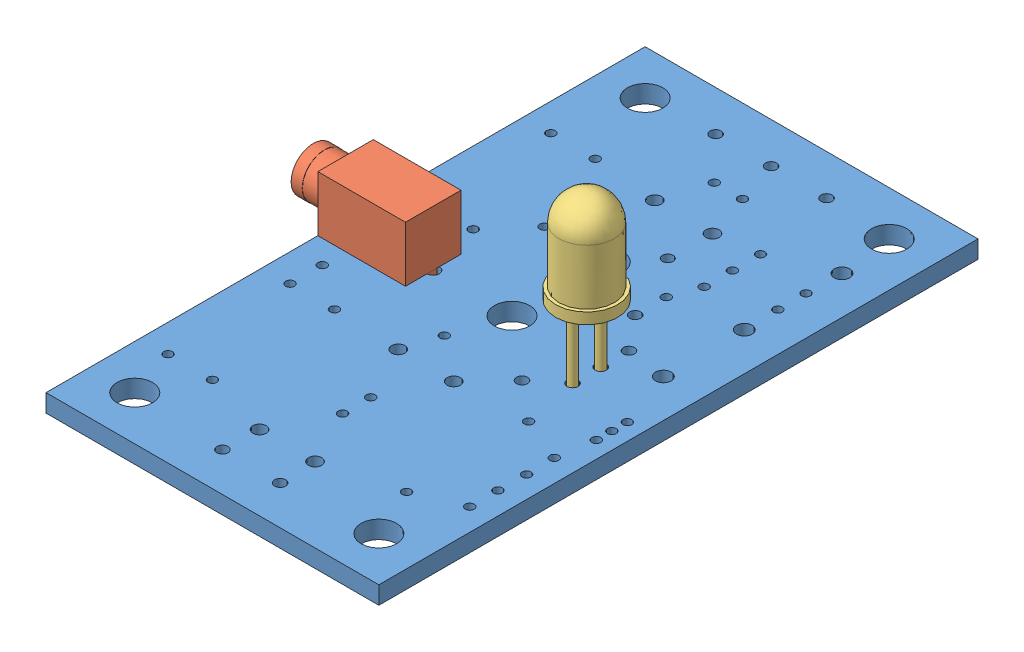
SolidWorks assembly Module K-AP-MECL.SLDASM, configuration Défaut (file format 8000). Lengths in mm.
Overall size (32.91 17.41 54).
4 component instances, 3 part files, 8 mates.
Components (placement in the parent):
- CI-AP-MLBP avec jack-1: CI-AP-MLBP avec jack.SLDASM [Défaut] at (1.5128 -1.8697 0) size (32.91 8.01 54)
  - CI BP et DEL-1: CI BP et DEL.SLDPRT [Défaut] at (-14.8869 -1.2382 0) size (30 1.6 54)
  - Embase jack 2.5-1: Embase jack 2.5.SLDPRT [Défaut] at (-14.8868 0.3618 -27.0002) size (10.81 8.01 5)
- DEL D5 BLANCHE-1: DEL D5 BLANCHE.SLDPRT [Défaut] at (9.6256 12.8921 -25.7302) x (0 0 -1) z (0 -1 0) size (5.3 5.6 16)
Mates (geometry in assembly coordinates):
- Coïncidente3: coincident aligned: axis of CI-AP-MLBP avec jack-1/CI BP et DEL-1 through (9.6256 -1.5079 -27.0002) axis (0 -1 0); axis of ? through (9.6256 0.8921 -27.0002) axis (0 -1 0)
- Coïncidente4: coincident aligned: axis of CI-AP-MLBP avec jack-1/CI BP et DEL-1 through (9.6256 -1.5079 -24.4602) axis (0 -1 0); axis of ? through (9.6256 0.8921 -24.4602) axis (0 -1 0)
- Coïncidente5: coincident aligned: plane of CI-AP-MLBP avec jack-1/CI BP et DEL-1 through (-13.3741 -3.1079 -54) normal (0 -1 0); plane of ? through (9.6256 -3.1079 -24.4602) normal (0 -1 0)
- Coïncidente6: coincident anti-aligned: axis of ? through (20.6256 2.8921 -25.7302) axis (1 0 0); axis of ? through (44.589 2.8921 -25.7302) axis (-1 0 0)
- Coïncidente7: coincident anti-aligned: plane of ? through (20.6256 2.8921 -25.7302) normal (1 0 0); plane of ? through (20.6256 4.7727 -27.3774) normal (-1 0 0)
- Coïncidente8: coincident: axis of CI-AP-MLBP avec jack-1/CI BP et DEL-1 through (9.6256 -1.5079 -27.0002) axis (0 -1 0); axis of DEL D5 BLANCHE-1 through (9.6256 -7.6079 -27.0002) axis (0 1 0)
- Coïncidente9: coincident: axis of CI-AP-MLBP avec jack-1/CI BP et DEL-1 through (9.6256 -1.5079 -24.4602) axis (0 -1 0); axis of DEL D5 BLANCHE-1 through (9.6256 -7.6079 -24.4602) axis (0 1 0)
- Coïncidente10: coincident aligned: plane of CI-AP-MLBP avec jack-1/CI BP et DEL-1 through (-13.3741 -3.1079 -54) normal (0 -1 0); plane of DEL D5 BLANCHE-1 through (9.6256 -3.1079 -27.0002) normal (0 -1 0)
